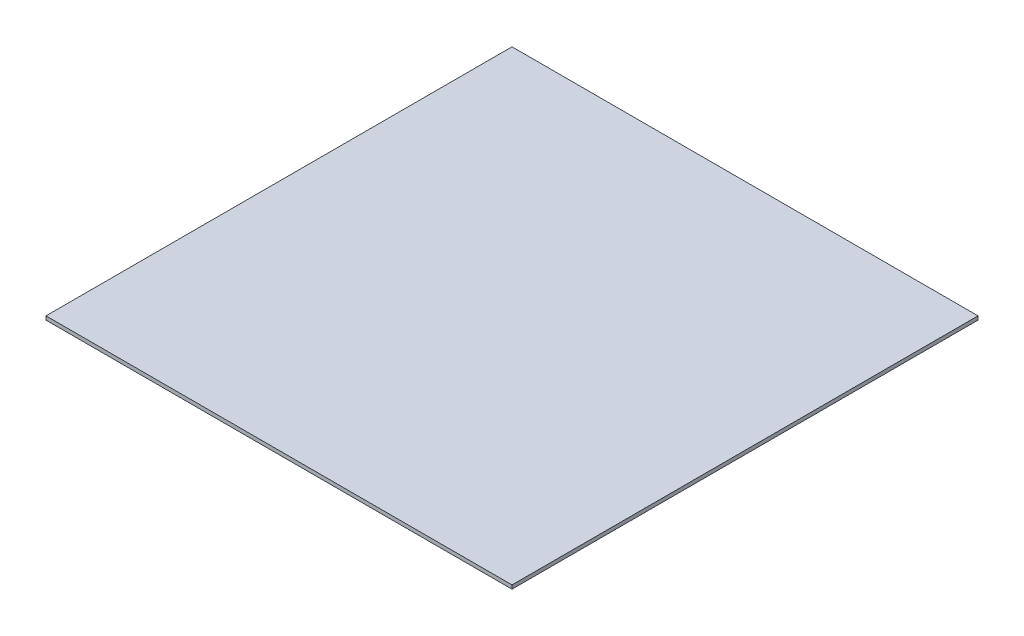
ISO-10303-21;
HEADER;
FILE_DESCRIPTION(('STEP AP214'),'2;1');
FILE_NAME('part.step','',(''),(''),'','','');
FILE_SCHEMA(('AUTOMOTIVE_DESIGN { 1 0 10303 214 1 1 1 1 }'));
ENDSEC;
DATA;
#1=APPLICATION_CONTEXT('core data for automotive mechanical design processes');
#2=APPLICATION_PROTOCOL_DEFINITION('international standard','automotive_design',2000,#1);
#3=PRODUCT_CONTEXT('',#1,'mechanical');
#4=PRODUCT('Part','Part','',(#3));
#5=PRODUCT_RELATED_PRODUCT_CATEGORY('part','',(#4));
#6=PRODUCT_DEFINITION_FORMATION('','',#4);
#7=PRODUCT_DEFINITION_CONTEXT('part definition',#1,'design');
#8=PRODUCT_DEFINITION('design','',#6,#7);
#9=PRODUCT_DEFINITION_SHAPE('','',#8);
#10=(LENGTH_UNIT() NAMED_UNIT(*) SI_UNIT(.MILLI.,.METRE.));
#11=(NAMED_UNIT(*) PLANE_ANGLE_UNIT() SI_UNIT($,.RADIAN.));
#12=(NAMED_UNIT(*) SI_UNIT($,.STERADIAN.) SOLID_ANGLE_UNIT());
#13=UNCERTAINTY_MEASURE_WITH_UNIT(LENGTH_MEASURE(1.E-05),#10,'distance_accuracy_value','');
#14=(GEOMETRIC_REPRESENTATION_CONTEXT(3) GLOBAL_UNCERTAINTY_ASSIGNED_CONTEXT((#13)) GLOBAL_UNIT_ASSIGNED_CONTEXT((#10,
#11,#12)) REPRESENTATION_CONTEXT('',''));
#15=CARTESIAN_POINT('',(0.,0.,0.));
#16=DIRECTION('',(0.,0.,1.));
#17=DIRECTION('',(1.,0.,0.));
#18=AXIS2_PLACEMENT_3D('',#15,#16,#17);
#19=CARTESIAN_POINT('',(125.,2.,-125.));
#20=DIRECTION('',(-1.,0.,0.));
#21=DIRECTION('',(0.,0.,1.));
#22=AXIS2_PLACEMENT_3D('',#19,#20,#21);
#23=PLANE('',#22);
#24=DIRECTION('',(0.,0.,-1.));
#25=VECTOR('',#24,1.);
#26=CARTESIAN_POINT('',(125.,0.,-125.));
#27=LINE('',#26,#25);
#28=CARTESIAN_POINT('',(125.,0.,125.));
#29=VERTEX_POINT('',#28);
#30=CARTESIAN_POINT('',(125.,0.,-125.));
#31=VERTEX_POINT('',#30);
#32=EDGE_CURVE('E97',#29,#31,#27,.T.);
#33=ORIENTED_EDGE('',*,*,#32,.T.);
#34=DIRECTION('',(0.,-1.,0.));
#35=VECTOR('',#34,1.);
#36=CARTESIAN_POINT('',(125.,2.,-125.));
#37=LINE('',#36,#35);
#38=CARTESIAN_POINT('',(125.,2.,-125.));
#39=VERTEX_POINT('',#38);
#40=EDGE_CURVE('E11',#39,#31,#37,.T.);
#41=ORIENTED_EDGE('',*,*,#40,.F.);
#42=DIRECTION('',(0.,0.,-1.));
#43=VECTOR('',#42,1.);
#44=CARTESIAN_POINT('',(125.,2.,-125.));
#45=LINE('',#44,#43);
#46=CARTESIAN_POINT('',(125.,2.,125.));
#47=VERTEX_POINT('',#46);
#48=EDGE_CURVE('E85',#47,#39,#45,.T.);
#49=ORIENTED_EDGE('',*,*,#48,.F.);
#50=DIRECTION('',(0.,-1.,0.));
#51=VECTOR('',#50,1.);
#52=CARTESIAN_POINT('',(125.,2.,125.));
#53=LINE('',#52,#51);
#54=EDGE_CURVE('E93',#47,#29,#53,.T.);
#55=ORIENTED_EDGE('',*,*,#54,.T.);
#56=EDGE_LOOP('',(#33,#41,#49,#55));
#57=FACE_BOUND('',#56,.T.);
#58=ADVANCED_FACE('F34',(#57),#23,.F.);
#59=CARTESIAN_POINT('',(-125.,2.,-125.));
#60=DIRECTION('',(0.,0.,1.));
#61=DIRECTION('',(1.,0.,0.));
#62=AXIS2_PLACEMENT_3D('',#59,#60,#61);
#63=PLANE('',#62);
#64=DIRECTION('',(-1.,0.,0.));
#65=VECTOR('',#64,1.);
#66=CARTESIAN_POINT('',(-125.,0.,-125.));
#67=LINE('',#66,#65);
#68=CARTESIAN_POINT('',(-125.,0.,-125.));
#69=VERTEX_POINT('',#68);
#70=EDGE_CURVE('E89',#31,#69,#67,.T.);
#71=ORIENTED_EDGE('',*,*,#70,.T.);
#72=DIRECTION('',(0.,-1.,0.));
#73=VECTOR('',#72,1.);
#74=CARTESIAN_POINT('',(-125.,2.,-125.));
#75=LINE('',#74,#73);
#76=CARTESIAN_POINT('',(-125.,2.,-125.));
#77=VERTEX_POINT('',#76);
#78=EDGE_CURVE('E42',#77,#69,#75,.T.);
#79=ORIENTED_EDGE('',*,*,#78,.F.);
#80=DIRECTION('',(-1.,0.,0.));
#81=VECTOR('',#80,1.);
#82=CARTESIAN_POINT('',(-125.,2.,-125.));
#83=LINE('',#82,#81);
#84=EDGE_CURVE('E80',#39,#77,#83,.T.);
#85=ORIENTED_EDGE('',*,*,#84,.F.);
#86=ORIENTED_EDGE('',*,*,#40,.T.);
#87=EDGE_LOOP('',(#71,#79,#85,#86));
#88=FACE_BOUND('',#87,.T.);
#89=ADVANCED_FACE('F88',(#88),#63,.F.);
#90=CARTESIAN_POINT('',(-125.,2.,-125.));
#91=DIRECTION('',(1.,0.,0.));
#92=DIRECTION('',(0.,0.,-1.));
#93=AXIS2_PLACEMENT_3D('',#90,#91,#92);
#94=PLANE('',#93);
#95=DIRECTION('',(0.,0.,1.));
#96=VECTOR('',#95,1.);
#97=CARTESIAN_POINT('',(-125.,0.,-125.));
#98=LINE('',#97,#96);
#99=CARTESIAN_POINT('',(-125.,0.,125.));
#100=VERTEX_POINT('',#99);
#101=EDGE_CURVE('E67',#69,#100,#98,.T.);
#102=ORIENTED_EDGE('',*,*,#101,.T.);
#103=DIRECTION('',(0.,-1.,0.));
#104=VECTOR('',#103,1.);
#105=CARTESIAN_POINT('',(-125.,2.,125.));
#106=LINE('',#105,#104);
#107=CARTESIAN_POINT('',(-125.,2.,125.));
#108=VERTEX_POINT('',#107);
#109=EDGE_CURVE('E90',#108,#100,#106,.T.);
#110=ORIENTED_EDGE('',*,*,#109,.F.);
#111=DIRECTION('',(0.,0.,1.));
#112=VECTOR('',#111,1.);
#113=CARTESIAN_POINT('',(-125.,2.,-125.));
#114=LINE('',#113,#112);
#115=EDGE_CURVE('E83',#77,#108,#114,.T.);
#116=ORIENTED_EDGE('',*,*,#115,.F.);
#117=ORIENTED_EDGE('',*,*,#78,.T.);
#118=EDGE_LOOP('',(#102,#110,#116,#117));
#119=FACE_BOUND('',#118,.T.);
#120=ADVANCED_FACE('F91',(#119),#94,.F.);
#121=CARTESIAN_POINT('',(-125.,2.,125.));
#122=DIRECTION('',(0.,0.,-1.));
#123=DIRECTION('',(-1.,0.,0.));
#124=AXIS2_PLACEMENT_3D('',#121,#122,#123);
#125=PLANE('',#124);
#126=DIRECTION('',(1.,0.,0.));
#127=VECTOR('',#126,1.);
#128=CARTESIAN_POINT('',(-125.,0.,125.));
#129=LINE('',#128,#127);
#130=EDGE_CURVE('E73',#100,#29,#129,.T.);
#131=ORIENTED_EDGE('',*,*,#130,.T.);
#132=ORIENTED_EDGE('',*,*,#54,.F.);
#133=DIRECTION('',(1.,0.,0.));
#134=VECTOR('',#133,1.);
#135=CARTESIAN_POINT('',(-125.,2.,125.));
#136=LINE('',#135,#134);
#137=EDGE_CURVE('E50',#108,#47,#136,.T.);
#138=ORIENTED_EDGE('',*,*,#137,.F.);
#139=ORIENTED_EDGE('',*,*,#109,.T.);
#140=EDGE_LOOP('',(#131,#132,#138,#139));
#141=FACE_BOUND('',#140,.T.);
#142=ADVANCED_FACE('F104',(#141),#125,.F.);
#143=CARTESIAN_POINT('',(0.,2.,0.));
#144=DIRECTION('',(0.,1.,0.));
#145=DIRECTION('',(0.,0.,1.));
#146=AXIS2_PLACEMENT_3D('',#143,#144,#145);
#147=PLANE('',#146);
#148=ORIENTED_EDGE('',*,*,#48,.T.);
#149=ORIENTED_EDGE('',*,*,#84,.T.);
#150=ORIENTED_EDGE('',*,*,#115,.T.);
#151=ORIENTED_EDGE('',*,*,#137,.T.);
#152=EDGE_LOOP('',(#148,#149,#150,#151));
#153=FACE_BOUND('',#152,.T.);
#154=ADVANCED_FACE('F81',(#153),#147,.T.);
#155=CARTESIAN_POINT('',(0.,0.,0.));
#156=DIRECTION('',(0.,1.,0.));
#157=DIRECTION('',(0.,0.,1.));
#158=AXIS2_PLACEMENT_3D('',#155,#156,#157);
#159=PLANE('',#158);
#160=ORIENTED_EDGE('',*,*,#32,.F.);
#161=ORIENTED_EDGE('',*,*,#130,.F.);
#162=ORIENTED_EDGE('',*,*,#101,.F.);
#163=ORIENTED_EDGE('',*,*,#70,.F.);
#164=EDGE_LOOP('',(#160,#161,#162,#163));
#165=FACE_BOUND('',#164,.T.);
#166=ADVANCED_FACE('F107',(#165),#159,.F.);
#167=CLOSED_SHELL('',(#58,#89,#120,#142,#154,#166));
#168=MANIFOLD_SOLID_BREP('B2',#167);
#169=ADVANCED_BREP_SHAPE_REPRESENTATION('',(#18,#168),#14);
#170=SHAPE_DEFINITION_REPRESENTATION(#9,#169);
ENDSEC;
END-ISO-10303-21;
